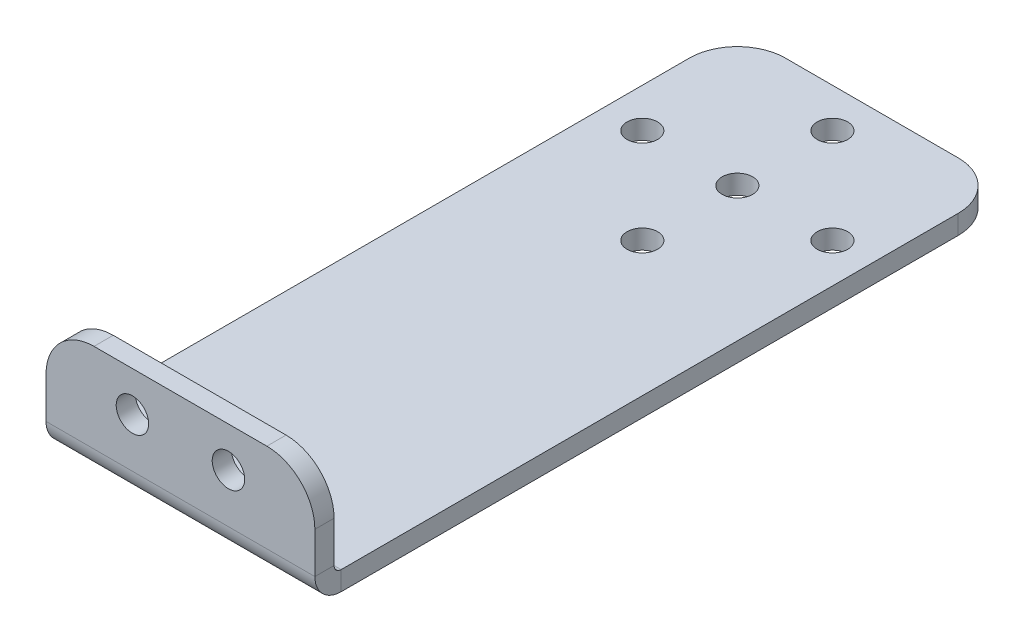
ISO-10303-21;
HEADER;
FILE_DESCRIPTION(('STEP AP214'),'2;1');
FILE_NAME('part.step','',(''),(''),'','','');
FILE_SCHEMA(('AUTOMOTIVE_DESIGN { 1 0 10303 214 1 1 1 1 }'));
ENDSEC;
DATA;
#1=APPLICATION_CONTEXT('core data for automotive mechanical design processes');
#2=APPLICATION_PROTOCOL_DEFINITION('international standard','automotive_design',2000,#1);
#3=PRODUCT_CONTEXT('',#1,'mechanical');
#4=PRODUCT('Part','Part','',(#3));
#5=PRODUCT_RELATED_PRODUCT_CATEGORY('part','',(#4));
#6=PRODUCT_DEFINITION_FORMATION('','',#4);
#7=PRODUCT_DEFINITION_CONTEXT('part definition',#1,'design');
#8=PRODUCT_DEFINITION('design','',#6,#7);
#9=PRODUCT_DEFINITION_SHAPE('','',#8);
#10=(LENGTH_UNIT() NAMED_UNIT(*) SI_UNIT(.MILLI.,.METRE.));
#11=(NAMED_UNIT(*) PLANE_ANGLE_UNIT() SI_UNIT($,.RADIAN.));
#12=(NAMED_UNIT(*) SI_UNIT($,.STERADIAN.) SOLID_ANGLE_UNIT());
#13=UNCERTAINTY_MEASURE_WITH_UNIT(LENGTH_MEASURE(1.E-05),#10,'distance_accuracy_value','');
#14=(GEOMETRIC_REPRESENTATION_CONTEXT(3) GLOBAL_UNCERTAINTY_ASSIGNED_CONTEXT((#13)) GLOBAL_UNIT_ASSIGNED_CONTEXT((#10,
#11,#12)) REPRESENTATION_CONTEXT('',''));
#15=CARTESIAN_POINT('',(0.,0.,0.));
#16=DIRECTION('',(0.,0.,1.));
#17=DIRECTION('',(1.,0.,0.));
#18=AXIS2_PLACEMENT_3D('',#15,#16,#17);
#19=CARTESIAN_POINT('',(14.,0.,-0.7366));
#20=DIRECTION('',(1.,0.,0.));
#21=DIRECTION('',(0.,0.,-1.));
#22=AXIS2_PLACEMENT_3D('',#19,#20,#21);
#23=PLANE('',#22);
#24=DIRECTION('',(0.,-1.,0.));
#25=VECTOR('',#24,1.);
#26=CARTESIAN_POINT('',(14.,0.,-0.7366));
#27=LINE('',#26,#25);
#28=CARTESIAN_POINT('',(14.,0.,-0.7366));
#29=VERTEX_POINT('',#28);
#30=CARTESIAN_POINT('',(14.,-2.,-0.7366));
#31=VERTEX_POINT('',#30);
#32=EDGE_CURVE('E125',#29,#31,#27,.T.);
#33=ORIENTED_EDGE('',*,*,#32,.F.);
#34=CARTESIAN_POINT('',(14.,0.7366,-0.7366));
#35=DIRECTION('',(-1.,0.,0.));
#36=DIRECTION('',(0.,0.,1.));
#37=AXIS2_PLACEMENT_3D('',#34,#35,#36);
#38=CIRCLE('',#37,0.7366);
#39=CARTESIAN_POINT('',(14.,0.7366,0.));
#40=VERTEX_POINT('',#39);
#41=EDGE_CURVE('E129',#40,#29,#38,.F.);
#42=ORIENTED_EDGE('',*,*,#41,.F.);
#43=DIRECTION('',(0.,0.,-1.));
#44=VECTOR('',#43,1.);
#45=CARTESIAN_POINT('',(14.,0.736600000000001,2.));
#46=LINE('',#45,#44);
#47=CARTESIAN_POINT('',(14.,0.736600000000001,2.));
#48=VERTEX_POINT('',#47);
#49=EDGE_CURVE('E137',#48,#40,#46,.T.);
#50=ORIENTED_EDGE('',*,*,#49,.F.);
#51=CARTESIAN_POINT('',(14.,0.7366,-0.7366));
#52=DIRECTION('',(1.,0.,0.));
#53=DIRECTION('',(0.,0.,-1.));
#54=AXIS2_PLACEMENT_3D('',#51,#52,#53);
#55=CIRCLE('',#54,2.7366);
#56=EDGE_CURVE('E131',#48,#31,#55,.T.);
#57=ORIENTED_EDGE('',*,*,#56,.T.);
#58=EDGE_LOOP('',(#33,#42,#50,#57));
#59=FACE_BOUND('',#58,.T.);
#60=ADVANCED_FACE('F34',(#59),#23,.T.);
#61=CARTESIAN_POINT('',(14.,0.736600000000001,2.));
#62=DIRECTION('',(1.,0.,0.));
#63=DIRECTION('',(0.,0.,-1.));
#64=AXIS2_PLACEMENT_3D('',#61,#62,#63);
#65=PLANE('',#64);
#66=DIRECTION('',(0.,0.,-1.));
#67=VECTOR('',#66,1.);
#68=CARTESIAN_POINT('',(14.,-2.,0.));
#69=LINE('',#68,#67);
#70=CARTESIAN_POINT('',(14.,-2.,-65.));
#71=VERTEX_POINT('',#70);
#72=EDGE_CURVE('E159',#31,#71,#69,.T.);
#73=ORIENTED_EDGE('',*,*,#72,.T.);
#74=DIRECTION('',(0.,-1.,0.));
#75=VECTOR('',#74,1.);
#76=CARTESIAN_POINT('',(14.,0.736600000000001,-65.));
#77=LINE('',#76,#75);
#78=CARTESIAN_POINT('',(14.,0.,-65.));
#79=VERTEX_POINT('',#78);
#80=EDGE_CURVE('E158',#71,#79,#77,.F.);
#81=ORIENTED_EDGE('',*,*,#80,.T.);
#82=DIRECTION('',(0.,0.,-1.));
#83=VECTOR('',#82,1.);
#84=CARTESIAN_POINT('',(14.,0.,0.));
#85=LINE('',#84,#83);
#86=EDGE_CURVE('E146',#29,#79,#85,.T.);
#87=ORIENTED_EDGE('',*,*,#86,.F.);
#88=ORIENTED_EDGE('',*,*,#32,.T.);
#89=EDGE_LOOP('',(#73,#81,#87,#88));
#90=FACE_BOUND('',#89,.T.);
#91=ADVANCED_FACE('F156',(#90),#65,.T.);
#92=CARTESIAN_POINT('',(-14.,0.7366,0.));
#93=DIRECTION('',(-1.,0.,0.));
#94=DIRECTION('',(0.,0.,1.));
#95=AXIS2_PLACEMENT_3D('',#92,#93,#94);
#96=PLANE('',#95);
#97=DIRECTION('',(0.,0.,1.));
#98=VECTOR('',#97,1.);
#99=CARTESIAN_POINT('',(-14.,0.7366,0.));
#100=LINE('',#99,#98);
#101=CARTESIAN_POINT('',(-14.,0.7366,0.));
#102=VERTEX_POINT('',#101);
#103=CARTESIAN_POINT('',(-14.,0.736600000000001,2.));
#104=VERTEX_POINT('',#103);
#105=EDGE_CURVE('E204',#102,#104,#100,.T.);
#106=ORIENTED_EDGE('',*,*,#105,.F.);
#107=CARTESIAN_POINT('',(-14.,0.7366,-0.7366));
#108=DIRECTION('',(-1.,0.,0.));
#109=DIRECTION('',(0.,0.,1.));
#110=AXIS2_PLACEMENT_3D('',#107,#108,#109);
#111=CIRCLE('',#110,0.7366);
#112=CARTESIAN_POINT('',(-14.,0.,-0.7366));
#113=VERTEX_POINT('',#112);
#114=EDGE_CURVE('E178',#102,#113,#111,.F.);
#115=ORIENTED_EDGE('',*,*,#114,.T.);
#116=DIRECTION('',(0.,1.,0.));
#117=VECTOR('',#116,1.);
#118=CARTESIAN_POINT('',(-14.,-2.,-0.7366));
#119=LINE('',#118,#117);
#120=CARTESIAN_POINT('',(-14.,-2.,-0.7366));
#121=VERTEX_POINT('',#120);
#122=EDGE_CURVE('E202',#121,#113,#119,.T.);
#123=ORIENTED_EDGE('',*,*,#122,.F.);
#124=CARTESIAN_POINT('',(-14.,0.7366,-0.7366));
#125=DIRECTION('',(1.,0.,0.));
#126=DIRECTION('',(0.,0.,-1.));
#127=AXIS2_PLACEMENT_3D('',#124,#125,#126);
#128=CIRCLE('',#127,2.7366);
#129=EDGE_CURVE('E184',#104,#121,#128,.T.);
#130=ORIENTED_EDGE('',*,*,#129,.F.);
#131=EDGE_LOOP('',(#106,#115,#123,#130));
#132=FACE_BOUND('',#131,.T.);
#133=ADVANCED_FACE('F328',(#132),#96,.T.);
#134=CARTESIAN_POINT('',(-14.,-2.,-0.7366));
#135=DIRECTION('',(-1.,0.,0.));
#136=DIRECTION('',(0.,0.,1.));
#137=AXIS2_PLACEMENT_3D('',#134,#135,#136);
#138=PLANE('',#137);
#139=DIRECTION('',(0.,-1.,0.));
#140=VECTOR('',#139,1.);
#141=CARTESIAN_POINT('',(-14.,10.,2.));
#142=LINE('',#141,#140);
#143=CARTESIAN_POINT('',(-14.,5.,2.));
#144=VERTEX_POINT('',#143);
#145=EDGE_CURVE('E182',#144,#104,#142,.T.);
#146=ORIENTED_EDGE('',*,*,#145,.F.);
#147=DIRECTION('',(0.,0.,-1.));
#148=VECTOR('',#147,1.);
#149=CARTESIAN_POINT('',(-14.,5.,-0.7366));
#150=LINE('',#149,#148);
#151=CARTESIAN_POINT('',(-14.,5.,0.));
#152=VERTEX_POINT('',#151);
#153=EDGE_CURVE('E11',#144,#152,#150,.T.);
#154=ORIENTED_EDGE('',*,*,#153,.T.);
#155=DIRECTION('',(0.,-1.,0.));
#156=VECTOR('',#155,1.);
#157=CARTESIAN_POINT('',(-14.,10.,0.));
#158=LINE('',#157,#156);
#159=EDGE_CURVE('E180',#152,#102,#158,.T.);
#160=ORIENTED_EDGE('',*,*,#159,.T.);
#161=ORIENTED_EDGE('',*,*,#105,.T.);
#162=EDGE_LOOP('',(#146,#154,#160,#161));
#163=FACE_BOUND('',#162,.T.);
#164=ADVANCED_FACE('F348',(#163),#138,.T.);
#165=CARTESIAN_POINT('',(14.,-2.,0.));
#166=DIRECTION('',(0.,1.,0.));
#167=DIRECTION('',(0.,0.,1.));
#168=AXIS2_PLACEMENT_3D('',#165,#166,#167);
#169=PLANE('',#168);
#170=CARTESIAN_POINT('',(0.,-2.,-65.9));
#171=DIRECTION('',(0.,-1.,0.));
#172=DIRECTION('',(0.,0.,-1.));
#173=AXIS2_PLACEMENT_3D('',#170,#171,#172);
#174=CIRCLE('',#173,1.59);
#175=CARTESIAN_POINT('',(0.,-2.,-67.49));
#176=VERTEX_POINT('',#175);
#177=EDGE_CURVE('E279',#176,#176,#174,.T.);
#178=ORIENTED_EDGE('',*,*,#177,.F.);
#179=EDGE_LOOP('',(#178));
#180=FACE_BOUND('',#179,.T.);
#181=CARTESIAN_POINT('',(-9.9,-2.,-56.));
#182=DIRECTION('',(0.,-1.,0.));
#183=DIRECTION('',(0.,0.,-1.));
#184=AXIS2_PLACEMENT_3D('',#181,#182,#183);
#185=CIRCLE('',#184,1.59000000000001);
#186=CARTESIAN_POINT('',(-9.9,-2.,-57.59));
#187=VERTEX_POINT('',#186);
#188=EDGE_CURVE('E273',#187,#187,#185,.T.);
#189=ORIENTED_EDGE('',*,*,#188,.F.);
#190=EDGE_LOOP('',(#189));
#191=FACE_BOUND('',#190,.T.);
#192=CARTESIAN_POINT('',(9.9,-2.,-56.));
#193=DIRECTION('',(0.,-1.,0.));
#194=DIRECTION('',(0.,0.,-1.));
#195=AXIS2_PLACEMENT_3D('',#192,#193,#194);
#196=CIRCLE('',#195,1.59000000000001);
#197=CARTESIAN_POINT('',(9.9,-2.,-57.59));
#198=VERTEX_POINT('',#197);
#199=EDGE_CURVE('E267',#198,#198,#196,.T.);
#200=ORIENTED_EDGE('',*,*,#199,.F.);
#201=EDGE_LOOP('',(#200));
#202=FACE_BOUND('',#201,.T.);
#203=CARTESIAN_POINT('',(0.,-2.,-46.1));
#204=DIRECTION('',(0.,-1.,0.));
#205=DIRECTION('',(0.,0.,-1.));
#206=AXIS2_PLACEMENT_3D('',#203,#204,#205);
#207=CIRCLE('',#206,1.59);
#208=CARTESIAN_POINT('',(0.,-2.,-47.69));
#209=VERTEX_POINT('',#208);
#210=EDGE_CURVE('E261',#209,#209,#207,.T.);
#211=ORIENTED_EDGE('',*,*,#210,.F.);
#212=EDGE_LOOP('',(#211));
#213=FACE_BOUND('',#212,.T.);
#214=CARTESIAN_POINT('',(0.,-2.,-56.));
#215=DIRECTION('',(0.,-1.,0.));
#216=DIRECTION('',(0.,0.,-1.));
#217=AXIS2_PLACEMENT_3D('',#214,#215,#216);
#218=CIRCLE('',#217,1.59);
#219=CARTESIAN_POINT('',(0.,-2.,-57.59));
#220=VERTEX_POINT('',#219);
#221=EDGE_CURVE('E176',#220,#220,#218,.T.);
#222=ORIENTED_EDGE('',*,*,#221,.F.);
#223=EDGE_LOOP('',(#222));
#224=FACE_BOUND('',#223,.T.);
#225=DIRECTION('',(0.,0.,-1.));
#226=VECTOR('',#225,1.);
#227=CARTESIAN_POINT('',(-14.,-2.,0.));
#228=LINE('',#227,#226);
#229=CARTESIAN_POINT('',(-14.,-2.,-65.));
#230=VERTEX_POINT('',#229);
#231=EDGE_CURVE('E173',#121,#230,#228,.T.);
#232=ORIENTED_EDGE('',*,*,#231,.T.);
#233=CARTESIAN_POINT('',(-9.,-2.,-65.));
#234=DIRECTION('',(0.,1.,0.));
#235=DIRECTION('',(0.,0.,1.));
#236=AXIS2_PLACEMENT_3D('',#233,#234,#235);
#237=CIRCLE('',#236,5.);
#238=CARTESIAN_POINT('',(-9.,-2.,-70.));
#239=VERTEX_POINT('',#238);
#240=EDGE_CURVE('E213',#230,#239,#237,.F.);
#241=ORIENTED_EDGE('',*,*,#240,.T.);
#242=DIRECTION('',(-1.,0.,0.));
#243=VECTOR('',#242,1.);
#244=CARTESIAN_POINT('',(14.,-2.,-70.));
#245=LINE('',#244,#243);
#246=CARTESIAN_POINT('',(9.,-2.,-70.));
#247=VERTEX_POINT('',#246);
#248=EDGE_CURVE('E199',#247,#239,#245,.T.);
#249=ORIENTED_EDGE('',*,*,#248,.F.);
#250=CARTESIAN_POINT('',(9.,-2.,-65.));
#251=DIRECTION('',(0.,1.,0.));
#252=DIRECTION('',(0.,0.,1.));
#253=AXIS2_PLACEMENT_3D('',#250,#251,#252);
#254=CIRCLE('',#253,5.);
#255=EDGE_CURVE('E211',#247,#71,#254,.F.);
#256=ORIENTED_EDGE('',*,*,#255,.T.);
#257=ORIENTED_EDGE('',*,*,#72,.F.);
#258=DIRECTION('',(-1.,0.,0.));
#259=VECTOR('',#258,1.);
#260=CARTESIAN_POINT('',(14.,-2.,-0.7366));
#261=LINE('',#260,#259);
#262=EDGE_CURVE('E172',#31,#121,#261,.T.);
#263=ORIENTED_EDGE('',*,*,#262,.T.);
#264=EDGE_LOOP('',(#232,#241,#249,#256,#257,#263));
#265=FACE_BOUND('',#264,.T.);
#266=ADVANCED_FACE('F255',(#180,#191,#202,#213,#224,#265),#169,.F.);
#267=CARTESIAN_POINT('',(14.,0.,-70.));
#268=DIRECTION('',(0.,0.,-1.));
#269=DIRECTION('',(-1.,0.,0.));
#270=AXIS2_PLACEMENT_3D('',#267,#268,#269);
#271=PLANE('',#270);
#272=ORIENTED_EDGE('',*,*,#248,.T.);
#273=DIRECTION('',(0.,-1.,0.));
#274=VECTOR('',#273,1.);
#275=CARTESIAN_POINT('',(-9.,0.,-70.));
#276=LINE('',#275,#274);
#277=CARTESIAN_POINT('',(-9.,0.,-70.));
#278=VERTEX_POINT('',#277);
#279=EDGE_CURVE('E218',#239,#278,#276,.F.);
#280=ORIENTED_EDGE('',*,*,#279,.T.);
#281=DIRECTION('',(-1.,0.,0.));
#282=VECTOR('',#281,1.);
#283=CARTESIAN_POINT('',(14.,0.,-70.));
#284=LINE('',#283,#282);
#285=CARTESIAN_POINT('',(9.,0.,-70.));
#286=VERTEX_POINT('',#285);
#287=EDGE_CURVE('E153',#286,#278,#284,.T.);
#288=ORIENTED_EDGE('',*,*,#287,.F.);
#289=DIRECTION('',(0.,-1.,0.));
#290=VECTOR('',#289,1.);
#291=CARTESIAN_POINT('',(9.,0.,-70.));
#292=LINE('',#291,#290);
#293=EDGE_CURVE('E215',#286,#247,#292,.T.);
#294=ORIENTED_EDGE('',*,*,#293,.T.);
#295=EDGE_LOOP('',(#272,#280,#288,#294));
#296=FACE_BOUND('',#295,.T.);
#297=ADVANCED_FACE('F356',(#296),#271,.T.);
#298=CARTESIAN_POINT('',(14.,0.,0.));
#299=DIRECTION('',(0.,1.,0.));
#300=DIRECTION('',(0.,0.,1.));
#301=AXIS2_PLACEMENT_3D('',#298,#299,#300);
#302=PLANE('',#301);
#303=CARTESIAN_POINT('',(0.,0.,-65.9));
#304=DIRECTION('',(0.,1.,0.));
#305=DIRECTION('',(0.,0.,1.));
#306=AXIS2_PLACEMENT_3D('',#303,#304,#305);
#307=CIRCLE('',#306,1.59);
#308=CARTESIAN_POINT('',(0.,0.,-64.31));
#309=VERTEX_POINT('',#308);
#310=EDGE_CURVE('E282',#309,#309,#307,.F.);
#311=ORIENTED_EDGE('',*,*,#310,.T.);
#312=EDGE_LOOP('',(#311));
#313=FACE_BOUND('',#312,.T.);
#314=CARTESIAN_POINT('',(-9.9,0.,-56.));
#315=DIRECTION('',(0.,1.,0.));
#316=DIRECTION('',(0.,0.,1.));
#317=AXIS2_PLACEMENT_3D('',#314,#315,#316);
#318=CIRCLE('',#317,1.59000000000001);
#319=CARTESIAN_POINT('',(-9.9,0.,-54.41));
#320=VERTEX_POINT('',#319);
#321=EDGE_CURVE('E276',#320,#320,#318,.F.);
#322=ORIENTED_EDGE('',*,*,#321,.T.);
#323=EDGE_LOOP('',(#322));
#324=FACE_BOUND('',#323,.T.);
#325=CARTESIAN_POINT('',(9.9,0.,-56.));
#326=DIRECTION('',(0.,1.,0.));
#327=DIRECTION('',(0.,0.,1.));
#328=AXIS2_PLACEMENT_3D('',#325,#326,#327);
#329=CIRCLE('',#328,1.59000000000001);
#330=CARTESIAN_POINT('',(9.9,0.,-54.41));
#331=VERTEX_POINT('',#330);
#332=EDGE_CURVE('E270',#331,#331,#329,.F.);
#333=ORIENTED_EDGE('',*,*,#332,.T.);
#334=EDGE_LOOP('',(#333));
#335=FACE_BOUND('',#334,.T.);
#336=CARTESIAN_POINT('',(0.,0.,-46.1));
#337=DIRECTION('',(0.,1.,0.));
#338=DIRECTION('',(0.,0.,1.));
#339=AXIS2_PLACEMENT_3D('',#336,#337,#338);
#340=CIRCLE('',#339,1.59);
#341=CARTESIAN_POINT('',(0.,0.,-44.51));
#342=VERTEX_POINT('',#341);
#343=EDGE_CURVE('E264',#342,#342,#340,.F.);
#344=ORIENTED_EDGE('',*,*,#343,.T.);
#345=EDGE_LOOP('',(#344));
#346=FACE_BOUND('',#345,.T.);
#347=CARTESIAN_POINT('',(0.,0.,-56.));
#348=DIRECTION('',(0.,1.,0.));
#349=DIRECTION('',(0.,0.,1.));
#350=AXIS2_PLACEMENT_3D('',#347,#348,#349);
#351=CIRCLE('',#350,1.59);
#352=CARTESIAN_POINT('',(0.,0.,-54.41));
#353=VERTEX_POINT('',#352);
#354=EDGE_CURVE('E258',#353,#353,#351,.F.);
#355=ORIENTED_EDGE('',*,*,#354,.T.);
#356=EDGE_LOOP('',(#355));
#357=FACE_BOUND('',#356,.T.);
#358=ORIENTED_EDGE('',*,*,#287,.T.);
#359=CARTESIAN_POINT('',(-9.,0.,-65.));
#360=DIRECTION('',(0.,1.,0.));
#361=DIRECTION('',(0.,0.,1.));
#362=AXIS2_PLACEMENT_3D('',#359,#360,#361);
#363=CIRCLE('',#362,5.);
#364=CARTESIAN_POINT('',(-14.,0.,-65.));
#365=VERTEX_POINT('',#364);
#366=EDGE_CURVE('E222',#278,#365,#363,.T.);
#367=ORIENTED_EDGE('',*,*,#366,.T.);
#368=DIRECTION('',(0.,0.,-1.));
#369=VECTOR('',#368,1.);
#370=CARTESIAN_POINT('',(-14.,0.,0.));
#371=LINE('',#370,#369);
#372=EDGE_CURVE('E149',#113,#365,#371,.T.);
#373=ORIENTED_EDGE('',*,*,#372,.F.);
#374=DIRECTION('',(-1.,0.,0.));
#375=VECTOR('',#374,1.);
#376=CARTESIAN_POINT('',(14.,0.,-0.7366));
#377=LINE('',#376,#375);
#378=EDGE_CURVE('E143',#29,#113,#377,.T.);
#379=ORIENTED_EDGE('',*,*,#378,.F.);
#380=ORIENTED_EDGE('',*,*,#86,.T.);
#381=CARTESIAN_POINT('',(9.,0.,-65.));
#382=DIRECTION('',(0.,1.,0.));
#383=DIRECTION('',(0.,0.,1.));
#384=AXIS2_PLACEMENT_3D('',#381,#382,#383);
#385=CIRCLE('',#384,5.);
#386=EDGE_CURVE('E220',#79,#286,#385,.T.);
#387=ORIENTED_EDGE('',*,*,#386,.T.);
#388=EDGE_LOOP('',(#358,#367,#373,#379,#380,#387));
#389=FACE_BOUND('',#388,.T.);
#390=ADVANCED_FACE('F145',(#313,#324,#335,#346,#357,#389),#302,.T.);
#391=CARTESIAN_POINT('',(14.,0.7366,-0.7366));
#392=DIRECTION('',(-1.,0.,0.));
#393=DIRECTION('',(0.,0.,1.));
#394=AXIS2_PLACEMENT_3D('',#391,#392,#393);
#395=CYLINDRICAL_SURFACE('',#394,0.7366);
#396=ORIENTED_EDGE('',*,*,#114,.F.);
#397=DIRECTION('',(-1.,0.,0.));
#398=VECTOR('',#397,1.);
#399=CARTESIAN_POINT('',(14.,0.7366,0.));
#400=LINE('',#399,#398);
#401=EDGE_CURVE('E154',#40,#102,#400,.T.);
#402=ORIENTED_EDGE('',*,*,#401,.F.);
#403=ORIENTED_EDGE('',*,*,#41,.T.);
#404=ORIENTED_EDGE('',*,*,#378,.T.);
#405=EDGE_LOOP('',(#396,#402,#403,#404));
#406=FACE_BOUND('',#405,.T.);
#407=ADVANCED_FACE('F162',(#406),#395,.F.);
#408=CARTESIAN_POINT('',(14.,10.,0.));
#409=DIRECTION('',(0.,0.,-1.));
#410=DIRECTION('',(0.,1.,0.));
#411=AXIS2_PLACEMENT_3D('',#408,#409,#410);
#412=PLANE('',#411);
#413=CARTESIAN_POINT('',(5.,5.85,0.));
#414=DIRECTION('',(0.,0.,-1.));
#415=DIRECTION('',(0.,1.,0.));
#416=AXIS2_PLACEMENT_3D('',#413,#414,#415);
#417=CIRCLE('',#416,1.69);
#418=CARTESIAN_POINT('',(5.,7.54,0.));
#419=VERTEX_POINT('',#418);
#420=EDGE_CURVE('E294',#419,#419,#417,.F.);
#421=ORIENTED_EDGE('',*,*,#420,.T.);
#422=EDGE_LOOP('',(#421));
#423=FACE_BOUND('',#422,.T.);
#424=CARTESIAN_POINT('',(-5.,5.85,0.));
#425=DIRECTION('',(0.,0.,-1.));
#426=DIRECTION('',(0.,1.,0.));
#427=AXIS2_PLACEMENT_3D('',#424,#425,#426);
#428=CIRCLE('',#427,1.69);
#429=CARTESIAN_POINT('',(-5.,7.54,0.));
#430=VERTEX_POINT('',#429);
#431=EDGE_CURVE('E288',#430,#430,#428,.F.);
#432=ORIENTED_EDGE('',*,*,#431,.T.);
#433=EDGE_LOOP('',(#432));
#434=FACE_BOUND('',#433,.T.);
#435=DIRECTION('',(-1.,0.,0.));
#436=VECTOR('',#435,1.);
#437=CARTESIAN_POINT('',(14.,10.,0.));
#438=LINE('',#437,#436);
#439=CARTESIAN_POINT('',(9.,10.,0.));
#440=VERTEX_POINT('',#439);
#441=CARTESIAN_POINT('',(-9.,10.,0.));
#442=VERTEX_POINT('',#441);
#443=EDGE_CURVE('E194',#440,#442,#438,.T.);
#444=ORIENTED_EDGE('',*,*,#443,.F.);
#445=CARTESIAN_POINT('',(9.,5.,0.));
#446=DIRECTION('',(0.,0.,-1.));
#447=DIRECTION('',(0.,1.,0.));
#448=AXIS2_PLACEMENT_3D('',#445,#446,#447);
#449=CIRCLE('',#448,5.);
#450=CARTESIAN_POINT('',(14.,5.,0.));
#451=VERTEX_POINT('',#450);
#452=EDGE_CURVE('E232',#440,#451,#449,.T.);
#453=ORIENTED_EDGE('',*,*,#452,.T.);
#454=DIRECTION('',(0.,-1.,0.));
#455=VECTOR('',#454,1.);
#456=CARTESIAN_POINT('',(14.,10.,0.));
#457=LINE('',#456,#455);
#458=EDGE_CURVE('E164',#451,#40,#457,.T.);
#459=ORIENTED_EDGE('',*,*,#458,.T.);
#460=ORIENTED_EDGE('',*,*,#401,.T.);
#461=ORIENTED_EDGE('',*,*,#159,.F.);
#462=CARTESIAN_POINT('',(-9.,5.,0.));
#463=DIRECTION('',(0.,0.,-1.));
#464=DIRECTION('',(0.,1.,0.));
#465=AXIS2_PLACEMENT_3D('',#462,#463,#464);
#466=CIRCLE('',#465,5.);
#467=EDGE_CURVE('E230',#152,#442,#466,.T.);
#468=ORIENTED_EDGE('',*,*,#467,.T.);
#469=EDGE_LOOP('',(#444,#453,#459,#460,#461,#468));
#470=FACE_BOUND('',#469,.T.);
#471=ADVANCED_FACE('F247',(#423,#434,#470),#412,.T.);
#472=CARTESIAN_POINT('',(14.,10.,2.));
#473=DIRECTION('',(0.,1.,0.));
#474=DIRECTION('',(0.,0.,1.));
#475=AXIS2_PLACEMENT_3D('',#472,#473,#474);
#476=PLANE('',#475);
#477=DIRECTION('',(-1.,0.,0.));
#478=VECTOR('',#477,1.);
#479=CARTESIAN_POINT('',(14.,10.,2.));
#480=LINE('',#479,#478);
#481=CARTESIAN_POINT('',(9.,10.,2.));
#482=VERTEX_POINT('',#481);
#483=CARTESIAN_POINT('',(-9.,10.,2.));
#484=VERTEX_POINT('',#483);
#485=EDGE_CURVE('E192',#482,#484,#480,.T.);
#486=ORIENTED_EDGE('',*,*,#485,.F.);
#487=DIRECTION('',(0.,0.,-1.));
#488=VECTOR('',#487,1.);
#489=CARTESIAN_POINT('',(9.,10.,0.));
#490=LINE('',#489,#488);
#491=EDGE_CURVE('E227',#482,#440,#490,.T.);
#492=ORIENTED_EDGE('',*,*,#491,.T.);
#493=ORIENTED_EDGE('',*,*,#443,.T.);
#494=DIRECTION('',(0.,0.,-1.));
#495=VECTOR('',#494,1.);
#496=CARTESIAN_POINT('',(-9.,10.,2.));
#497=LINE('',#496,#495);
#498=EDGE_CURVE('E225',#442,#484,#497,.F.);
#499=ORIENTED_EDGE('',*,*,#498,.T.);
#500=EDGE_LOOP('',(#486,#492,#493,#499));
#501=FACE_BOUND('',#500,.T.);
#502=ADVANCED_FACE('F242',(#501),#476,.T.);
#503=CARTESIAN_POINT('',(14.,10.,2.));
#504=DIRECTION('',(0.,0.,-1.));
#505=DIRECTION('',(0.,1.,0.));
#506=AXIS2_PLACEMENT_3D('',#503,#504,#505);
#507=PLANE('',#506);
#508=CARTESIAN_POINT('',(5.,5.85,2.));
#509=DIRECTION('',(0.,0.,1.));
#510=DIRECTION('',(1.,0.,0.));
#511=AXIS2_PLACEMENT_3D('',#508,#509,#510);
#512=CIRCLE('',#511,1.69);
#513=CARTESIAN_POINT('',(6.69,5.85,2.));
#514=VERTEX_POINT('',#513);
#515=EDGE_CURVE('E291',#514,#514,#512,.T.);
#516=ORIENTED_EDGE('',*,*,#515,.F.);
#517=EDGE_LOOP('',(#516));
#518=FACE_BOUND('',#517,.T.);
#519=CARTESIAN_POINT('',(-5.,5.85,2.));
#520=DIRECTION('',(0.,0.,1.));
#521=DIRECTION('',(1.,0.,0.));
#522=AXIS2_PLACEMENT_3D('',#519,#520,#521);
#523=CIRCLE('',#522,1.69);
#524=CARTESIAN_POINT('',(-3.31,5.85,2.));
#525=VERTEX_POINT('',#524);
#526=EDGE_CURVE('E285',#525,#525,#523,.T.);
#527=ORIENTED_EDGE('',*,*,#526,.F.);
#528=EDGE_LOOP('',(#527));
#529=FACE_BOUND('',#528,.T.);
#530=DIRECTION('',(0.,-1.,0.));
#531=VECTOR('',#530,1.);
#532=CARTESIAN_POINT('',(14.,10.,2.));
#533=LINE('',#532,#531);
#534=CARTESIAN_POINT('',(14.,5.,2.));
#535=VERTEX_POINT('',#534);
#536=EDGE_CURVE('E166',#535,#48,#533,.T.);
#537=ORIENTED_EDGE('',*,*,#536,.F.);
#538=CARTESIAN_POINT('',(9.,5.,2.));
#539=DIRECTION('',(0.,0.,-1.));
#540=DIRECTION('',(0.,1.,0.));
#541=AXIS2_PLACEMENT_3D('',#538,#539,#540);
#542=CIRCLE('',#541,5.);
#543=EDGE_CURVE('E42',#535,#482,#542,.F.);
#544=ORIENTED_EDGE('',*,*,#543,.T.);
#545=ORIENTED_EDGE('',*,*,#485,.T.);
#546=CARTESIAN_POINT('',(-9.,5.,2.));
#547=DIRECTION('',(0.,0.,-1.));
#548=DIRECTION('',(0.,1.,0.));
#549=AXIS2_PLACEMENT_3D('',#546,#547,#548);
#550=CIRCLE('',#549,5.);
#551=EDGE_CURVE('E49',#484,#144,#550,.F.);
#552=ORIENTED_EDGE('',*,*,#551,.T.);
#553=ORIENTED_EDGE('',*,*,#145,.T.);
#554=DIRECTION('',(-1.,0.,0.));
#555=VECTOR('',#554,1.);
#556=CARTESIAN_POINT('',(14.,0.736600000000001,2.));
#557=LINE('',#556,#555);
#558=EDGE_CURVE('E189',#48,#104,#557,.T.);
#559=ORIENTED_EDGE('',*,*,#558,.F.);
#560=EDGE_LOOP('',(#537,#544,#545,#552,#553,#559));
#561=FACE_BOUND('',#560,.T.);
#562=ADVANCED_FACE('F237',(#518,#529,#561),#507,.F.);
#563=CARTESIAN_POINT('',(14.,0.7366,-0.7366));
#564=DIRECTION('',(-1.,0.,0.));
#565=DIRECTION('',(0.,0.,1.));
#566=AXIS2_PLACEMENT_3D('',#563,#564,#565);
#567=CYLINDRICAL_SURFACE('',#566,2.7366);
#568=ORIENTED_EDGE('',*,*,#129,.T.);
#569=ORIENTED_EDGE('',*,*,#262,.F.);
#570=ORIENTED_EDGE('',*,*,#56,.F.);
#571=ORIENTED_EDGE('',*,*,#558,.T.);
#572=EDGE_LOOP('',(#568,#569,#570,#571));
#573=FACE_BOUND('',#572,.T.);
#574=ADVANCED_FACE('F251',(#573),#567,.T.);
#575=CARTESIAN_POINT('',(14.,0.7366,-0.7366));
#576=DIRECTION('',(-1.,0.,0.));
#577=DIRECTION('',(0.,0.,1.));
#578=AXIS2_PLACEMENT_3D('',#575,#576,#577);
#579=PLANE('',#578);
#580=ORIENTED_EDGE('',*,*,#458,.F.);
#581=DIRECTION('',(0.,0.,-1.));
#582=VECTOR('',#581,1.);
#583=CARTESIAN_POINT('',(14.,5.,2.));
#584=LINE('',#583,#582);
#585=EDGE_CURVE('E57',#451,#535,#584,.F.);
#586=ORIENTED_EDGE('',*,*,#585,.T.);
#587=ORIENTED_EDGE('',*,*,#536,.T.);
#588=ORIENTED_EDGE('',*,*,#49,.T.);
#589=EDGE_LOOP('',(#580,#586,#587,#588));
#590=FACE_BOUND('',#589,.T.);
#591=ADVANCED_FACE('F248',(#590),#579,.F.);
#592=CARTESIAN_POINT('',(-14.,0.7366,-0.7366));
#593=DIRECTION('',(-1.,0.,0.));
#594=DIRECTION('',(0.,0.,1.));
#595=AXIS2_PLACEMENT_3D('',#592,#593,#594);
#596=PLANE('',#595);
#597=ORIENTED_EDGE('',*,*,#372,.T.);
#598=DIRECTION('',(0.,-1.,0.));
#599=VECTOR('',#598,1.);
#600=CARTESIAN_POINT('',(-14.,0.7366,-65.));
#601=LINE('',#600,#599);
#602=EDGE_CURVE('E136',#365,#230,#601,.T.);
#603=ORIENTED_EDGE('',*,*,#602,.T.);
#604=ORIENTED_EDGE('',*,*,#231,.F.);
#605=ORIENTED_EDGE('',*,*,#122,.T.);
#606=EDGE_LOOP('',(#597,#603,#604,#605));
#607=FACE_BOUND('',#606,.T.);
#608=ADVANCED_FACE('F352',(#607),#596,.T.);
#609=CARTESIAN_POINT('',(0.,10.001,-56.));
#610=DIRECTION('',(0.,-1.,0.));
#611=DIRECTION('',(0.,0.,-1.));
#612=AXIS2_PLACEMENT_3D('',#609,#610,#611);
#613=CYLINDRICAL_SURFACE('',#612,1.59);
#614=ORIENTED_EDGE('',*,*,#354,.F.);
#615=EDGE_LOOP('',(#614));
#616=FACE_BOUND('',#615,.T.);
#617=ORIENTED_EDGE('',*,*,#221,.T.);
#618=EDGE_LOOP('',(#617));
#619=FACE_BOUND('',#618,.T.);
#620=ADVANCED_FACE('F448',(#616,#619),#613,.F.);
#621=CARTESIAN_POINT('',(0.,10.001,-46.1));
#622=DIRECTION('',(0.,-1.,0.));
#623=DIRECTION('',(0.,0.,-1.));
#624=AXIS2_PLACEMENT_3D('',#621,#622,#623);
#625=CYLINDRICAL_SURFACE('',#624,1.59);
#626=ORIENTED_EDGE('',*,*,#343,.F.);
#627=EDGE_LOOP('',(#626));
#628=FACE_BOUND('',#627,.T.);
#629=ORIENTED_EDGE('',*,*,#210,.T.);
#630=EDGE_LOOP('',(#629));
#631=FACE_BOUND('',#630,.T.);
#632=ADVANCED_FACE('F527',(#628,#631),#625,.F.);
#633=CARTESIAN_POINT('',(9.9,10.001,-56.));
#634=DIRECTION('',(0.,-1.,0.));
#635=DIRECTION('',(0.,0.,-1.));
#636=AXIS2_PLACEMENT_3D('',#633,#634,#635);
#637=CYLINDRICAL_SURFACE('',#636,1.59000000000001);
#638=ORIENTED_EDGE('',*,*,#332,.F.);
#639=EDGE_LOOP('',(#638));
#640=FACE_BOUND('',#639,.T.);
#641=ORIENTED_EDGE('',*,*,#199,.T.);
#642=EDGE_LOOP('',(#641));
#643=FACE_BOUND('',#642,.T.);
#644=ADVANCED_FACE('F538',(#640,#643),#637,.F.);
#645=CARTESIAN_POINT('',(-9.9,10.001,-56.));
#646=DIRECTION('',(0.,-1.,0.));
#647=DIRECTION('',(0.,0.,-1.));
#648=AXIS2_PLACEMENT_3D('',#645,#646,#647);
#649=CYLINDRICAL_SURFACE('',#648,1.59000000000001);
#650=ORIENTED_EDGE('',*,*,#321,.F.);
#651=EDGE_LOOP('',(#650));
#652=FACE_BOUND('',#651,.T.);
#653=ORIENTED_EDGE('',*,*,#188,.T.);
#654=EDGE_LOOP('',(#653));
#655=FACE_BOUND('',#654,.T.);
#656=ADVANCED_FACE('F319',(#652,#655),#649,.F.);
#657=CARTESIAN_POINT('',(0.,10.001,-65.9));
#658=DIRECTION('',(0.,-1.,0.));
#659=DIRECTION('',(0.,0.,-1.));
#660=AXIS2_PLACEMENT_3D('',#657,#658,#659);
#661=CYLINDRICAL_SURFACE('',#660,1.59);
#662=ORIENTED_EDGE('',*,*,#310,.F.);
#663=EDGE_LOOP('',(#662));
#664=FACE_BOUND('',#663,.T.);
#665=ORIENTED_EDGE('',*,*,#177,.T.);
#666=EDGE_LOOP('',(#665));
#667=FACE_BOUND('',#666,.T.);
#668=ADVANCED_FACE('F309',(#664,#667),#661,.F.);
#669=CARTESIAN_POINT('',(-5.,5.85,-70.001));
#670=DIRECTION('',(0.,0.,1.));
#671=DIRECTION('',(1.,0.,0.));
#672=AXIS2_PLACEMENT_3D('',#669,#670,#671);
#673=CYLINDRICAL_SURFACE('',#672,1.69);
#674=ORIENTED_EDGE('',*,*,#431,.F.);
#675=EDGE_LOOP('',(#674));
#676=FACE_BOUND('',#675,.T.);
#677=ORIENTED_EDGE('',*,*,#526,.T.);
#678=EDGE_LOOP('',(#677));
#679=FACE_BOUND('',#678,.T.);
#680=ADVANCED_FACE('F307',(#676,#679),#673,.F.);
#681=CARTESIAN_POINT('',(5.,5.85,-70.001));
#682=DIRECTION('',(0.,0.,1.));
#683=DIRECTION('',(1.,0.,0.));
#684=AXIS2_PLACEMENT_3D('',#681,#682,#683);
#685=CYLINDRICAL_SURFACE('',#684,1.69);
#686=ORIENTED_EDGE('',*,*,#420,.F.);
#687=EDGE_LOOP('',(#686));
#688=FACE_BOUND('',#687,.T.);
#689=ORIENTED_EDGE('',*,*,#515,.T.);
#690=EDGE_LOOP('',(#689));
#691=FACE_BOUND('',#690,.T.);
#692=ADVANCED_FACE('F300',(#688,#691),#685,.F.);
#693=CARTESIAN_POINT('',(-9.,0.7366,-65.));
#694=DIRECTION('',(0.,-1.,0.));
#695=DIRECTION('',(0.,0.,-1.));
#696=AXIS2_PLACEMENT_3D('',#693,#694,#695);
#697=CYLINDRICAL_SURFACE('',#696,5.);
#698=ORIENTED_EDGE('',*,*,#366,.F.);
#699=ORIENTED_EDGE('',*,*,#279,.F.);
#700=ORIENTED_EDGE('',*,*,#240,.F.);
#701=ORIENTED_EDGE('',*,*,#602,.F.);
#702=EDGE_LOOP('',(#698,#699,#700,#701));
#703=FACE_BOUND('',#702,.T.);
#704=ADVANCED_FACE('F316',(#703),#697,.T.);
#705=CARTESIAN_POINT('',(9.,0.,-65.));
#706=DIRECTION('',(0.,-1.,0.));
#707=DIRECTION('',(0.,0.,-1.));
#708=AXIS2_PLACEMENT_3D('',#705,#706,#707);
#709=CYLINDRICAL_SURFACE('',#708,5.);
#710=ORIENTED_EDGE('',*,*,#386,.F.);
#711=ORIENTED_EDGE('',*,*,#80,.F.);
#712=ORIENTED_EDGE('',*,*,#255,.F.);
#713=ORIENTED_EDGE('',*,*,#293,.F.);
#714=EDGE_LOOP('',(#710,#711,#712,#713));
#715=FACE_BOUND('',#714,.T.);
#716=ADVANCED_FACE('F334',(#715),#709,.T.);
#717=CARTESIAN_POINT('',(9.,5.,2.));
#718=DIRECTION('',(0.,0.,1.));
#719=DIRECTION('',(1.,0.,0.));
#720=AXIS2_PLACEMENT_3D('',#717,#718,#719);
#721=CYLINDRICAL_SURFACE('',#720,5.);
#722=ORIENTED_EDGE('',*,*,#543,.F.);
#723=ORIENTED_EDGE('',*,*,#585,.F.);
#724=ORIENTED_EDGE('',*,*,#452,.F.);
#725=ORIENTED_EDGE('',*,*,#491,.F.);
#726=EDGE_LOOP('',(#722,#723,#724,#725));
#727=FACE_BOUND('',#726,.T.);
#728=ADVANCED_FACE('F245',(#727),#721,.T.);
#729=CARTESIAN_POINT('',(-9.,5.,-0.7366));
#730=DIRECTION('',(0.,0.,-1.));
#731=DIRECTION('',(-1.,0.,0.));
#732=AXIS2_PLACEMENT_3D('',#729,#730,#731);
#733=CYLINDRICAL_SURFACE('',#732,5.);
#734=ORIENTED_EDGE('',*,*,#551,.F.);
#735=ORIENTED_EDGE('',*,*,#498,.F.);
#736=ORIENTED_EDGE('',*,*,#467,.F.);
#737=ORIENTED_EDGE('',*,*,#153,.F.);
#738=EDGE_LOOP('',(#734,#735,#736,#737));
#739=FACE_BOUND('',#738,.T.);
#740=ADVANCED_FACE('F36',(#739),#733,.T.);
#741=CLOSED_SHELL('',(#60,#91,#133,#164,#266,#297,#390,#407,#471,#502,#562,#574,#591,#608,#620,
#632,#644,#656,#668,#680,#692,#704,#716,#728,#740));
#742=MANIFOLD_SOLID_BREP('B2',#741);
#743=ADVANCED_BREP_SHAPE_REPRESENTATION('',(#18,#742),#14);
#744=SHAPE_DEFINITION_REPRESENTATION(#9,#743);
ENDSEC;
END-ISO-10303-21;
